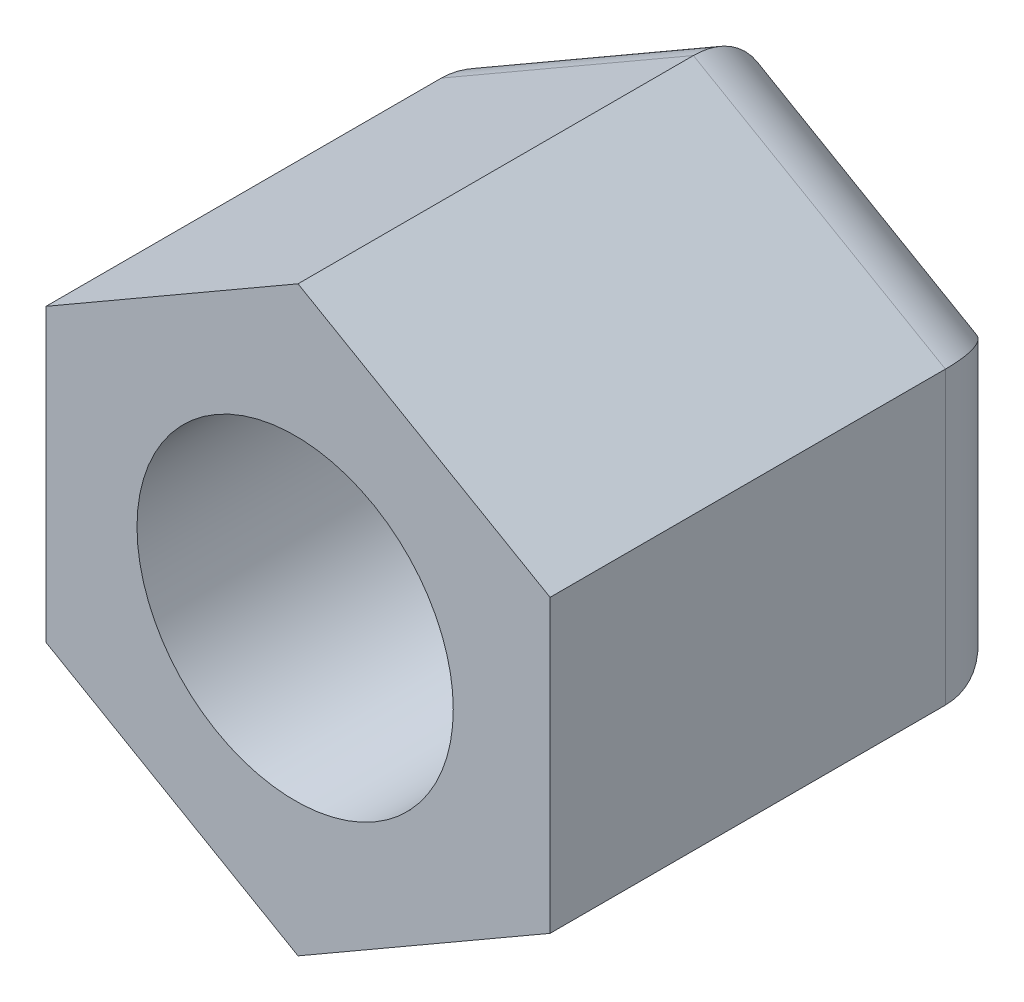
ISO-10303-21;
HEADER;
FILE_DESCRIPTION(('STEP AP214'),'2;1');
FILE_NAME('part.step','',(''),(''),'','','');
FILE_SCHEMA(('AUTOMOTIVE_DESIGN { 1 0 10303 214 1 1 1 1 }'));
ENDSEC;
DATA;
#1=APPLICATION_CONTEXT('core data for automotive mechanical design processes');
#2=APPLICATION_PROTOCOL_DEFINITION('international standard','automotive_design',2000,#1);
#3=PRODUCT_CONTEXT('',#1,'mechanical');
#4=PRODUCT('Part','Part','',(#3));
#5=PRODUCT_RELATED_PRODUCT_CATEGORY('part','',(#4));
#6=PRODUCT_DEFINITION_FORMATION('','',#4);
#7=PRODUCT_DEFINITION_CONTEXT('part definition',#1,'design');
#8=PRODUCT_DEFINITION('design','',#6,#7);
#9=PRODUCT_DEFINITION_SHAPE('','',#8);
#10=(LENGTH_UNIT() NAMED_UNIT(*) SI_UNIT(.MILLI.,.METRE.));
#11=(NAMED_UNIT(*) PLANE_ANGLE_UNIT() SI_UNIT($,.RADIAN.));
#12=(NAMED_UNIT(*) SI_UNIT($,.STERADIAN.) SOLID_ANGLE_UNIT());
#13=UNCERTAINTY_MEASURE_WITH_UNIT(LENGTH_MEASURE(1.E-05),#10,'distance_accuracy_value','');
#14=(GEOMETRIC_REPRESENTATION_CONTEXT(3) GLOBAL_UNCERTAINTY_ASSIGNED_CONTEXT((#13)) GLOBAL_UNIT_ASSIGNED_CONTEXT((#10,
#11,#12)) REPRESENTATION_CONTEXT('',''));
#15=CARTESIAN_POINT('',(0.,0.,0.));
#16=DIRECTION('',(0.,0.,1.));
#17=DIRECTION('',(1.,0.,0.));
#18=AXIS2_PLACEMENT_3D('',#15,#16,#17);
#19=CARTESIAN_POINT('',(-6.30165145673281,3.68060796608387,0.));
#20=DIRECTION('',(-0.5,0.866025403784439,0.));
#21=DIRECTION('',(-0.866025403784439,-0.5,0.));
#22=AXIS2_PLACEMENT_3D('',#19,#20,#21);
#23=PLANE('',#22);
#24=DIRECTION('',(-0.866025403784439,-0.5,0.));
#25=VECTOR('',#24,1.);
#26=CARTESIAN_POINT('',(0.073348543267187,7.36121593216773,12.));
#27=LINE('',#26,#25);
#28=CARTESIAN_POINT('',(0.0733485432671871,7.36121593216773,12.));
#29=VERTEX_POINT('',#28);
#30=CARTESIAN_POINT('',(-6.30165145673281,3.68060796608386,12.));
#31=VERTEX_POINT('',#30);
#32=EDGE_CURVE('E128',#29,#31,#27,.T.);
#33=ORIENTED_EDGE('',*,*,#32,.F.);
#34=DIRECTION('',(0.,0.,1.));
#35=VECTOR('',#34,1.);
#36=CARTESIAN_POINT('',(0.073348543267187,7.36121593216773,0.));
#37=LINE('',#36,#35);
#38=CARTESIAN_POINT('',(0.073348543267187,7.36121593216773,2.));
#39=VERTEX_POINT('',#38);
#40=EDGE_CURVE('E116',#39,#29,#37,.T.);
#41=ORIENTED_EDGE('',*,*,#40,.F.);
#42=DIRECTION('',(0.866025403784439,0.5,0.));
#43=VECTOR('',#42,1.);
#44=CARTESIAN_POINT('',(-4.70790145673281,4.60075995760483,2.));
#45=LINE('',#44,#43);
#46=CARTESIAN_POINT('',(-6.30165145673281,3.68060796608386,2.));
#47=VERTEX_POINT('',#46);
#48=EDGE_CURVE('E147',#47,#39,#45,.T.);
#49=ORIENTED_EDGE('',*,*,#48,.F.);
#50=DIRECTION('',(0.,0.,1.));
#51=VECTOR('',#50,1.);
#52=CARTESIAN_POINT('',(-6.30165145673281,3.68060796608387,0.));
#53=LINE('',#52,#51);
#54=EDGE_CURVE('E113',#31,#47,#53,.F.);
#55=ORIENTED_EDGE('',*,*,#54,.F.);
#56=EDGE_LOOP('',(#33,#41,#49,#55));
#57=FACE_BOUND('',#56,.T.);
#58=ADVANCED_FACE('F16',(#57),#23,.T.);
#59=CARTESIAN_POINT('',(-6.30165145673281,-3.68060796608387,0.));
#60=DIRECTION('',(-1.,0.,0.));
#61=DIRECTION('',(0.,0.,1.));
#62=AXIS2_PLACEMENT_3D('',#59,#60,#61);
#63=PLANE('',#62);
#64=DIRECTION('',(0.,1.,0.));
#65=VECTOR('',#64,1.);
#66=CARTESIAN_POINT('',(-6.30165145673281,0.,12.));
#67=LINE('',#66,#65);
#68=CARTESIAN_POINT('',(-6.30165145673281,-3.68060796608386,12.));
#69=VERTEX_POINT('',#68);
#70=EDGE_CURVE('E131',#31,#69,#67,.F.);
#71=ORIENTED_EDGE('',*,*,#70,.F.);
#72=ORIENTED_EDGE('',*,*,#54,.T.);
#73=DIRECTION('',(0.,1.,0.));
#74=VECTOR('',#73,1.);
#75=CARTESIAN_POINT('',(-6.30165145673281,-1.84030398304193,2.));
#76=LINE('',#75,#74);
#77=CARTESIAN_POINT('',(-6.30165145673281,-3.68060796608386,2.));
#78=VERTEX_POINT('',#77);
#79=EDGE_CURVE('E144',#78,#47,#76,.T.);
#80=ORIENTED_EDGE('',*,*,#79,.F.);
#81=DIRECTION('',(0.,0.,1.));
#82=VECTOR('',#81,1.);
#83=CARTESIAN_POINT('',(-6.30165145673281,-3.68060796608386,0.));
#84=LINE('',#83,#82);
#85=EDGE_CURVE('E76',#69,#78,#84,.F.);
#86=ORIENTED_EDGE('',*,*,#85,.F.);
#87=EDGE_LOOP('',(#71,#72,#80,#86));
#88=FACE_BOUND('',#87,.T.);
#89=ADVANCED_FACE('F278',(#88),#63,.T.);
#90=CARTESIAN_POINT('',(0.073348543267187,-7.36121593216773,0.));
#91=DIRECTION('',(-0.5,-0.866025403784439,0.));
#92=DIRECTION('',(0.866025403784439,-0.5,0.));
#93=AXIS2_PLACEMENT_3D('',#90,#91,#92);
#94=PLANE('',#93);
#95=DIRECTION('',(0.866025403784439,-0.5,0.));
#96=VECTOR('',#95,1.);
#97=CARTESIAN_POINT('',(-6.30165145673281,-3.68060796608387,12.));
#98=LINE('',#97,#96);
#99=CARTESIAN_POINT('',(0.0733485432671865,-7.36121593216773,12.));
#100=VERTEX_POINT('',#99);
#101=EDGE_CURVE('E134',#69,#100,#98,.T.);
#102=ORIENTED_EDGE('',*,*,#101,.F.);
#103=ORIENTED_EDGE('',*,*,#85,.T.);
#104=DIRECTION('',(-0.866025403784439,0.5,0.));
#105=VECTOR('',#104,1.);
#106=CARTESIAN_POINT('',(-1.52040145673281,-6.44106394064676,2.));
#107=LINE('',#106,#105);
#108=CARTESIAN_POINT('',(0.0733485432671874,-7.36121593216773,2.));
#109=VERTEX_POINT('',#108);
#110=EDGE_CURVE('E85',#109,#78,#107,.T.);
#111=ORIENTED_EDGE('',*,*,#110,.F.);
#112=DIRECTION('',(0.,0.,1.));
#113=VECTOR('',#112,1.);
#114=CARTESIAN_POINT('',(0.0733485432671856,-7.36121593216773,0.));
#115=LINE('',#114,#113);
#116=EDGE_CURVE('E63',#100,#109,#115,.F.);
#117=ORIENTED_EDGE('',*,*,#116,.F.);
#118=EDGE_LOOP('',(#102,#103,#111,#117));
#119=FACE_BOUND('',#118,.T.);
#120=ADVANCED_FACE('F89',(#119),#94,.T.);
#121=CARTESIAN_POINT('',(6.44834854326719,-3.68060796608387,0.));
#122=DIRECTION('',(0.5,-0.866025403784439,0.));
#123=DIRECTION('',(0.866025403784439,0.5,0.));
#124=AXIS2_PLACEMENT_3D('',#121,#122,#123);
#125=PLANE('',#124);
#126=DIRECTION('',(0.866025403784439,0.5,0.));
#127=VECTOR('',#126,1.);
#128=CARTESIAN_POINT('',(0.073348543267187,-7.36121593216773,12.));
#129=LINE('',#128,#127);
#130=CARTESIAN_POINT('',(6.44834854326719,-3.68060796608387,12.));
#131=VERTEX_POINT('',#130);
#132=EDGE_CURVE('E71',#100,#131,#129,.T.);
#133=ORIENTED_EDGE('',*,*,#132,.F.);
#134=ORIENTED_EDGE('',*,*,#116,.T.);
#135=DIRECTION('',(-0.866025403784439,-0.5,0.));
#136=VECTOR('',#135,1.);
#137=CARTESIAN_POINT('',(4.85459854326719,-4.60075995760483,2.));
#138=LINE('',#137,#136);
#139=CARTESIAN_POINT('',(6.44834854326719,-3.68060796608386,2.));
#140=VERTEX_POINT('',#139);
#141=EDGE_CURVE('E67',#140,#109,#138,.T.);
#142=ORIENTED_EDGE('',*,*,#141,.F.);
#143=DIRECTION('',(0.,0.,-1.));
#144=VECTOR('',#143,1.);
#145=CARTESIAN_POINT('',(6.44834854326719,-3.68060796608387,0.));
#146=LINE('',#145,#144);
#147=EDGE_CURVE('E75',#131,#140,#146,.T.);
#148=ORIENTED_EDGE('',*,*,#147,.F.);
#149=EDGE_LOOP('',(#133,#134,#142,#148));
#150=FACE_BOUND('',#149,.T.);
#151=ADVANCED_FACE('F65',(#150),#125,.T.);
#152=CARTESIAN_POINT('',(6.44834854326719,3.68060796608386,0.));
#153=DIRECTION('',(1.,0.,0.));
#154=DIRECTION('',(0.,0.,-1.));
#155=AXIS2_PLACEMENT_3D('',#152,#153,#154);
#156=PLANE('',#155);
#157=DIRECTION('',(0.,1.,0.));
#158=VECTOR('',#157,1.);
#159=CARTESIAN_POINT('',(6.44834854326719,0.,12.));
#160=LINE('',#159,#158);
#161=CARTESIAN_POINT('',(6.44834854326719,3.68060796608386,12.));
#162=VERTEX_POINT('',#161);
#163=EDGE_CURVE('E122',#131,#162,#160,.T.);
#164=ORIENTED_EDGE('',*,*,#163,.F.);
#165=ORIENTED_EDGE('',*,*,#147,.T.);
#166=DIRECTION('',(0.,-1.,0.));
#167=VECTOR('',#166,1.);
#168=CARTESIAN_POINT('',(6.44834854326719,1.84030398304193,2.));
#169=LINE('',#168,#167);
#170=CARTESIAN_POINT('',(6.44834854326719,3.68060796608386,2.));
#171=VERTEX_POINT('',#170);
#172=EDGE_CURVE('E100',#171,#140,#169,.T.);
#173=ORIENTED_EDGE('',*,*,#172,.F.);
#174=DIRECTION('',(0.,0.,1.));
#175=VECTOR('',#174,1.);
#176=CARTESIAN_POINT('',(6.44834854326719,3.68060796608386,0.));
#177=LINE('',#176,#175);
#178=EDGE_CURVE('E94',#162,#171,#177,.F.);
#179=ORIENTED_EDGE('',*,*,#178,.F.);
#180=EDGE_LOOP('',(#164,#165,#173,#179));
#181=FACE_BOUND('',#180,.T.);
#182=ADVANCED_FACE('F257',(#181),#156,.T.);
#183=CARTESIAN_POINT('',(0.073348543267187,7.36121593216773,0.));
#184=DIRECTION('',(0.5,0.866025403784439,0.));
#185=DIRECTION('',(-0.866025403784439,0.5,0.));
#186=AXIS2_PLACEMENT_3D('',#183,#184,#185);
#187=PLANE('',#186);
#188=DIRECTION('',(-0.866025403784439,0.5,0.));
#189=VECTOR('',#188,1.);
#190=CARTESIAN_POINT('',(6.44834854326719,3.68060796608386,12.));
#191=LINE('',#190,#189);
#192=EDGE_CURVE('E125',#162,#29,#191,.T.);
#193=ORIENTED_EDGE('',*,*,#192,.F.);
#194=ORIENTED_EDGE('',*,*,#178,.T.);
#195=DIRECTION('',(0.866025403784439,-0.5,0.));
#196=VECTOR('',#195,1.);
#197=CARTESIAN_POINT('',(1.66709854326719,6.44106394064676,2.));
#198=LINE('',#197,#196);
#199=EDGE_CURVE('E106',#39,#171,#198,.T.);
#200=ORIENTED_EDGE('',*,*,#199,.F.);
#201=ORIENTED_EDGE('',*,*,#40,.T.);
#202=EDGE_LOOP('',(#193,#194,#200,#201));
#203=FACE_BOUND('',#202,.T.);
#204=ADVANCED_FACE('F250',(#203),#187,.T.);
#205=CARTESIAN_POINT('',(-0.520401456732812,-4.70901313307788,2.));
#206=DIRECTION('',(-0.866025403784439,0.5,0.));
#207=DIRECTION('',(-0.5,-0.866025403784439,0.));
#208=AXIS2_PLACEMENT_3D('',#205,#206,#207);
#209=CYLINDRICAL_SURFACE('',#208,2.);
#210=DIRECTION('',(0.866025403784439,-0.5,0.));
#211=VECTOR('',#210,1.);
#212=CARTESIAN_POINT('',(-4.30165145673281,-2.52590742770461,0.));
#213=LINE('',#212,#211);
#214=CARTESIAN_POINT('',(-4.30165145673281,-2.52590742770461,0.));
#215=VERTEX_POINT('',#214);
#216=CARTESIAN_POINT('',(0.0733485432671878,-5.05181485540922,0.));
#217=VERTEX_POINT('',#216);
#218=EDGE_CURVE('E99',#215,#217,#213,.T.);
#219=ORIENTED_EDGE('',*,*,#218,.T.);
#220=CARTESIAN_POINT('',(0.0733485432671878,-5.05181485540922,2.));
#221=DIRECTION('',(-1.,0.,0.));
#222=DIRECTION('',(0.,-1.,0.));
#223=AXIS2_PLACEMENT_3D('',#220,#221,#222);
#224=ELLIPSE('',#223,2.3094010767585,2.);
#225=EDGE_CURVE('E19',#109,#217,#224,.F.);
#226=ORIENTED_EDGE('',*,*,#225,.F.);
#227=ORIENTED_EDGE('',*,*,#110,.T.);
#228=CARTESIAN_POINT('',(-4.30165145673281,-2.52590742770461,2.));
#229=DIRECTION('',(-0.5,0.866025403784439,0.));
#230=DIRECTION('',(0.866025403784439,0.5,0.));
#231=AXIS2_PLACEMENT_3D('',#228,#229,#230);
#232=ELLIPSE('',#231,2.3094010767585,2.);
#233=EDGE_CURVE('E132',#215,#78,#232,.T.);
#234=ORIENTED_EDGE('',*,*,#233,.F.);
#235=EDGE_LOOP('',(#219,#226,#227,#234));
#236=FACE_BOUND('',#235,.T.);
#237=ADVANCED_FACE('F97',(#236),#209,.T.);
#238=CARTESIAN_POINT('',(3.85459854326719,-2.86870915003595,2.));
#239=DIRECTION('',(-0.866025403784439,-0.5,0.));
#240=DIRECTION('',(0.5,-0.866025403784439,0.));
#241=AXIS2_PLACEMENT_3D('',#238,#239,#240);
#242=CYLINDRICAL_SURFACE('',#241,2.);
#243=DIRECTION('',(0.866025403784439,0.5,0.));
#244=VECTOR('',#243,1.);
#245=CARTESIAN_POINT('',(0.073348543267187,-5.05181485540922,0.));
#246=LINE('',#245,#244);
#247=CARTESIAN_POINT('',(4.44834854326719,-2.52590742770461,0.));
#248=VERTEX_POINT('',#247);
#249=EDGE_CURVE('E111',#217,#248,#246,.T.);
#250=ORIENTED_EDGE('',*,*,#249,.T.);
#251=CARTESIAN_POINT('',(4.44834854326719,-2.52590742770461,2.));
#252=DIRECTION('',(-0.5,-0.866025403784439,0.));
#253=DIRECTION('',(0.866025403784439,-0.5,0.));
#254=AXIS2_PLACEMENT_3D('',#251,#252,#253);
#255=ELLIPSE('',#254,2.3094010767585,2.);
#256=EDGE_CURVE('E84',#140,#248,#255,.F.);
#257=ORIENTED_EDGE('',*,*,#256,.F.);
#258=ORIENTED_EDGE('',*,*,#141,.T.);
#259=ORIENTED_EDGE('',*,*,#225,.T.);
#260=EDGE_LOOP('',(#250,#257,#258,#259));
#261=FACE_BOUND('',#260,.T.);
#262=ADVANCED_FACE('F81',(#261),#242,.T.);
#263=CARTESIAN_POINT('',(4.44834854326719,1.84030398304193,2.));
#264=DIRECTION('',(0.,-1.,0.));
#265=DIRECTION('',(0.,0.,-1.));
#266=AXIS2_PLACEMENT_3D('',#263,#264,#265);
#267=CYLINDRICAL_SURFACE('',#266,2.);
#268=DIRECTION('',(0.,1.,0.));
#269=VECTOR('',#268,1.);
#270=CARTESIAN_POINT('',(4.44834854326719,0.,0.));
#271=LINE('',#270,#269);
#272=CARTESIAN_POINT('',(4.44834854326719,2.52590742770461,0.));
#273=VERTEX_POINT('',#272);
#274=EDGE_CURVE('E109',#248,#273,#271,.T.);
#275=ORIENTED_EDGE('',*,*,#274,.T.);
#276=CARTESIAN_POINT('',(4.44834854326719,2.52590742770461,2.));
#277=DIRECTION('',(0.5,-0.866025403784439,0.));
#278=DIRECTION('',(0.866025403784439,0.5,0.));
#279=AXIS2_PLACEMENT_3D('',#276,#277,#278);
#280=ELLIPSE('',#279,2.3094010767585,2.);
#281=EDGE_CURVE('E148',#171,#273,#280,.F.);
#282=ORIENTED_EDGE('',*,*,#281,.F.);
#283=ORIENTED_EDGE('',*,*,#172,.T.);
#284=ORIENTED_EDGE('',*,*,#256,.T.);
#285=EDGE_LOOP('',(#275,#282,#283,#284));
#286=FACE_BOUND('',#285,.T.);
#287=ADVANCED_FACE('F184',(#286),#267,.T.);
#288=CARTESIAN_POINT('',(0.667098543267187,4.70901313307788,2.));
#289=DIRECTION('',(0.866025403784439,-0.5,0.));
#290=DIRECTION('',(0.5,0.866025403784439,0.));
#291=AXIS2_PLACEMENT_3D('',#288,#289,#290);
#292=CYLINDRICAL_SURFACE('',#291,2.);
#293=DIRECTION('',(-0.866025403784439,0.5,0.));
#294=VECTOR('',#293,1.);
#295=CARTESIAN_POINT('',(4.44834854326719,2.52590742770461,0.));
#296=LINE('',#295,#294);
#297=CARTESIAN_POINT('',(0.0733485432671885,5.05181485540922,0.));
#298=VERTEX_POINT('',#297);
#299=EDGE_CURVE('E158',#273,#298,#296,.T.);
#300=ORIENTED_EDGE('',*,*,#299,.T.);
#301=CARTESIAN_POINT('',(0.0733485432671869,5.05181485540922,2.));
#302=DIRECTION('',(1.,0.,0.));
#303=DIRECTION('',(0.,1.,0.));
#304=AXIS2_PLACEMENT_3D('',#301,#302,#303);
#305=ELLIPSE('',#304,2.3094010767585,2.);
#306=EDGE_CURVE('E145',#39,#298,#305,.F.);
#307=ORIENTED_EDGE('',*,*,#306,.F.);
#308=ORIENTED_EDGE('',*,*,#199,.T.);
#309=ORIENTED_EDGE('',*,*,#281,.T.);
#310=EDGE_LOOP('',(#300,#307,#308,#309));
#311=FACE_BOUND('',#310,.T.);
#312=ADVANCED_FACE('F182',(#311),#292,.T.);
#313=CARTESIAN_POINT('',(-3.70790145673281,2.86870915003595,2.));
#314=DIRECTION('',(0.866025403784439,0.5,0.));
#315=DIRECTION('',(-0.5,0.866025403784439,0.));
#316=AXIS2_PLACEMENT_3D('',#313,#314,#315);
#317=CYLINDRICAL_SURFACE('',#316,2.);
#318=DIRECTION('',(-0.866025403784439,-0.5,0.));
#319=VECTOR('',#318,1.);
#320=CARTESIAN_POINT('',(0.073348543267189,5.05181485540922,0.));
#321=LINE('',#320,#319);
#322=CARTESIAN_POINT('',(-4.30165145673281,2.52590742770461,0.));
#323=VERTEX_POINT('',#322);
#324=EDGE_CURVE('E159',#298,#323,#321,.T.);
#325=ORIENTED_EDGE('',*,*,#324,.T.);
#326=CARTESIAN_POINT('',(-4.30165145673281,2.52590742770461,2.));
#327=DIRECTION('',(0.5,0.866025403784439,0.));
#328=DIRECTION('',(-0.866025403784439,0.5,0.));
#329=AXIS2_PLACEMENT_3D('',#326,#327,#328);
#330=ELLIPSE('',#329,2.3094010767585,2.);
#331=EDGE_CURVE('E34',#47,#323,#330,.F.);
#332=ORIENTED_EDGE('',*,*,#331,.F.);
#333=ORIENTED_EDGE('',*,*,#48,.T.);
#334=ORIENTED_EDGE('',*,*,#306,.T.);
#335=EDGE_LOOP('',(#325,#332,#333,#334));
#336=FACE_BOUND('',#335,.T.);
#337=ADVANCED_FACE('F176',(#336),#317,.T.);
#338=CARTESIAN_POINT('',(-4.30165145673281,-1.84030398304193,2.));
#339=DIRECTION('',(0.,1.,0.));
#340=DIRECTION('',(0.,0.,1.));
#341=AXIS2_PLACEMENT_3D('',#338,#339,#340);
#342=CYLINDRICAL_SURFACE('',#341,2.);
#343=DIRECTION('',(0.,1.,0.));
#344=VECTOR('',#343,1.);
#345=CARTESIAN_POINT('',(-4.30165145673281,0.,0.));
#346=LINE('',#345,#344);
#347=EDGE_CURVE('E141',#323,#215,#346,.F.);
#348=ORIENTED_EDGE('',*,*,#347,.T.);
#349=ORIENTED_EDGE('',*,*,#233,.T.);
#350=ORIENTED_EDGE('',*,*,#79,.T.);
#351=ORIENTED_EDGE('',*,*,#331,.T.);
#352=EDGE_LOOP('',(#348,#349,#350,#351));
#353=FACE_BOUND('',#352,.T.);
#354=ADVANCED_FACE('F167',(#353),#342,.T.);
#355=CARTESIAN_POINT('',(0.073348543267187,0.,12.));
#356=DIRECTION('',(0.,0.,1.));
#357=DIRECTION('',(1.,0.,0.));
#358=AXIS2_PLACEMENT_3D('',#355,#356,#357);
#359=PLANE('',#358);
#360=CARTESIAN_POINT('',(0.,0.,12.));
#361=DIRECTION('',(0.,0.,1.));
#362=DIRECTION('',(1.,0.,0.));
#363=AXIS2_PLACEMENT_3D('',#360,#361,#362);
#364=CIRCLE('',#363,4.);
#365=CARTESIAN_POINT('',(4.,0.,12.));
#366=VERTEX_POINT('',#365);
#367=EDGE_CURVE('E25',#366,#366,#364,.F.);
#368=ORIENTED_EDGE('',*,*,#367,.T.);
#369=EDGE_LOOP('',(#368));
#370=FACE_BOUND('',#369,.T.);
#371=ORIENTED_EDGE('',*,*,#163,.T.);
#372=ORIENTED_EDGE('',*,*,#192,.T.);
#373=ORIENTED_EDGE('',*,*,#32,.T.);
#374=ORIENTED_EDGE('',*,*,#70,.T.);
#375=ORIENTED_EDGE('',*,*,#101,.T.);
#376=ORIENTED_EDGE('',*,*,#132,.T.);
#377=EDGE_LOOP('',(#371,#372,#373,#374,#375,#376));
#378=FACE_BOUND('',#377,.T.);
#379=ADVANCED_FACE('F200',(#370,#378),#359,.T.);
#380=CARTESIAN_POINT('',(0.073348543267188,0.,0.));
#381=DIRECTION('',(0.,0.,1.));
#382=DIRECTION('',(1.,0.,0.));
#383=AXIS2_PLACEMENT_3D('',#380,#381,#382);
#384=PLANE('',#383);
#385=CARTESIAN_POINT('',(0.,0.,0.));
#386=DIRECTION('',(0.,0.,1.));
#387=DIRECTION('',(1.,0.,0.));
#388=AXIS2_PLACEMENT_3D('',#385,#386,#387);
#389=CIRCLE('',#388,4.);
#390=CARTESIAN_POINT('',(4.,0.,0.));
#391=VERTEX_POINT('',#390);
#392=EDGE_CURVE('E11',#391,#391,#389,.T.);
#393=ORIENTED_EDGE('',*,*,#392,.T.);
#394=EDGE_LOOP('',(#393));
#395=FACE_BOUND('',#394,.T.);
#396=ORIENTED_EDGE('',*,*,#324,.F.);
#397=ORIENTED_EDGE('',*,*,#299,.F.);
#398=ORIENTED_EDGE('',*,*,#274,.F.);
#399=ORIENTED_EDGE('',*,*,#249,.F.);
#400=ORIENTED_EDGE('',*,*,#218,.F.);
#401=ORIENTED_EDGE('',*,*,#347,.F.);
#402=EDGE_LOOP('',(#396,#397,#398,#399,#400,#401));
#403=FACE_BOUND('',#402,.T.);
#404=ADVANCED_FACE('F179',(#395,#403),#384,.F.);
#405=CARTESIAN_POINT('',(0.,0.,0.));
#406=DIRECTION('',(0.,0.,1.));
#407=DIRECTION('',(1.,0.,0.));
#408=AXIS2_PLACEMENT_3D('',#405,#406,#407);
#409=CYLINDRICAL_SURFACE('',#408,4.);
#410=ORIENTED_EDGE('',*,*,#392,.F.);
#411=EDGE_LOOP('',(#410));
#412=FACE_BOUND('',#411,.T.);
#413=ORIENTED_EDGE('',*,*,#367,.F.);
#414=EDGE_LOOP('',(#413));
#415=FACE_BOUND('',#414,.T.);
#416=ADVANCED_FACE('F193',(#412,#415),#409,.F.);
#417=CLOSED_SHELL('',(#58,#89,#120,#151,#182,#204,#237,#262,#287,#312,#337,#354,#379,#404,#416));
#418=MANIFOLD_SOLID_BREP('B1',#417);
#419=ADVANCED_BREP_SHAPE_REPRESENTATION('',(#18,#418),#14);
#420=SHAPE_DEFINITION_REPRESENTATION(#9,#419);
ENDSEC;
END-ISO-10303-21;
